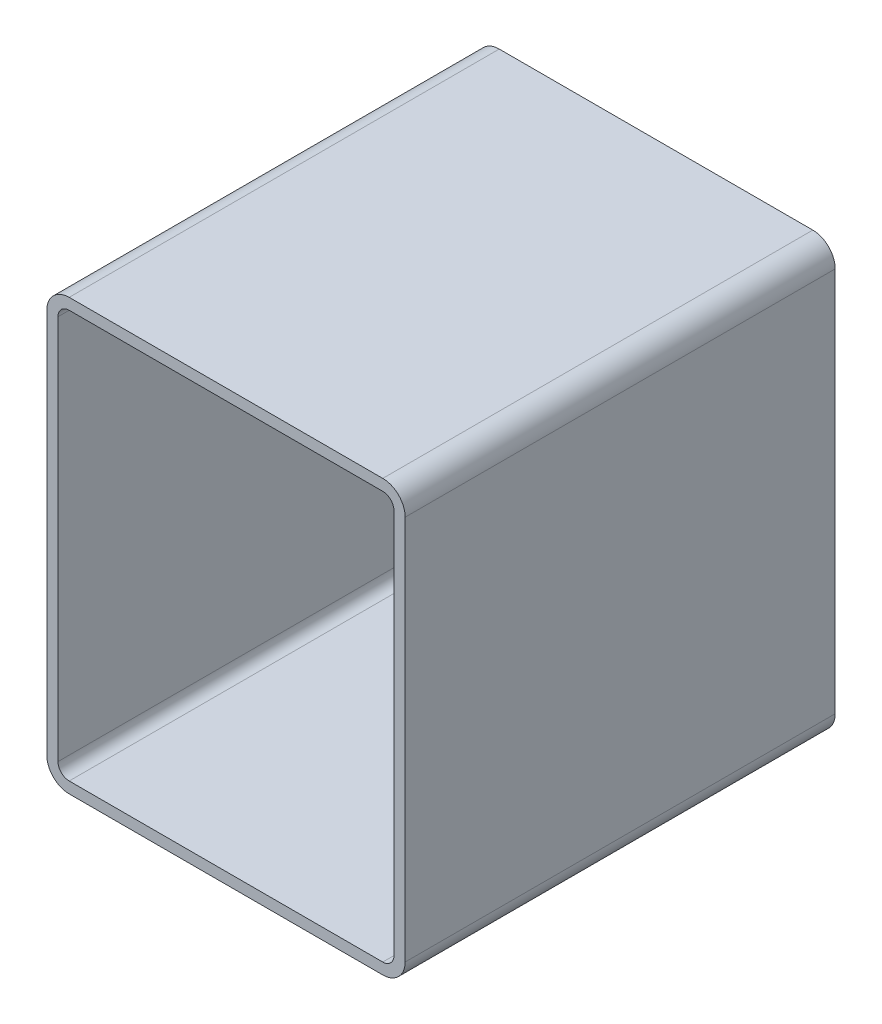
ISO-10303-21;
HEADER;
FILE_DESCRIPTION(('STEP AP214'),'2;1');
FILE_NAME('part.step','',(''),(''),'','','');
FILE_SCHEMA(('AUTOMOTIVE_DESIGN { 1 0 10303 214 1 1 1 1 }'));
ENDSEC;
DATA;
#1=APPLICATION_CONTEXT('core data for automotive mechanical design processes');
#2=APPLICATION_PROTOCOL_DEFINITION('international standard','automotive_design',2000,#1);
#3=PRODUCT_CONTEXT('',#1,'mechanical');
#4=PRODUCT('Part','Part','',(#3));
#5=PRODUCT_RELATED_PRODUCT_CATEGORY('part','',(#4));
#6=PRODUCT_DEFINITION_FORMATION('','',#4);
#7=PRODUCT_DEFINITION_CONTEXT('part definition',#1,'design');
#8=PRODUCT_DEFINITION('design','',#6,#7);
#9=PRODUCT_DEFINITION_SHAPE('','',#8);
#10=(LENGTH_UNIT() NAMED_UNIT(*) SI_UNIT(.MILLI.,.METRE.));
#11=(NAMED_UNIT(*) PLANE_ANGLE_UNIT() SI_UNIT($,.RADIAN.));
#12=(NAMED_UNIT(*) SI_UNIT($,.STERADIAN.) SOLID_ANGLE_UNIT());
#13=UNCERTAINTY_MEASURE_WITH_UNIT(LENGTH_MEASURE(1.E-05),#10,'distance_accuracy_value','');
#14=(GEOMETRIC_REPRESENTATION_CONTEXT(3) GLOBAL_UNCERTAINTY_ASSIGNED_CONTEXT((#13)) GLOBAL_UNIT_ASSIGNED_CONTEXT((#10,
#11,#12)) REPRESENTATION_CONTEXT('',''));
#15=CARTESIAN_POINT('',(0.,0.,0.));
#16=DIRECTION('',(0.,0.,1.));
#17=DIRECTION('',(1.,0.,0.));
#18=AXIS2_PLACEMENT_3D('',#15,#16,#17);
#19=CARTESIAN_POINT('',(18.6095794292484,290.799496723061,304.8));
#20=DIRECTION('',(0.,0.,1.));
#21=DIRECTION('',(1.,0.,0.));
#22=AXIS2_PLACEMENT_3D('',#19,#20,#21);
#23=PLANE('',#22);
#24=CARTESIAN_POINT('',(18.6095794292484,290.799496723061,304.8));
#25=DIRECTION('',(0.,0.,1.));
#26=DIRECTION('',(1.,0.,0.));
#27=AXIS2_PLACEMENT_3D('',#24,#25,#26);
#28=CIRCLE('',#27,15.875);
#29=CARTESIAN_POINT('',(18.6095794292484,306.674496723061,304.8));
#30=VERTEX_POINT('',#29);
#31=CARTESIAN_POINT('',(2.73457942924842,290.799496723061,304.8));
#32=VERTEX_POINT('',#31);
#33=EDGE_CURVE('E211',#30,#32,#28,.T.);
#34=ORIENTED_EDGE('',*,*,#33,.T.);
#35=DIRECTION('',(0.,-1.,0.));
#36=VECTOR('',#35,1.);
#37=CARTESIAN_POINT('',(2.73457942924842,17.7494967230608,304.8));
#38=LINE('',#37,#36);
#39=CARTESIAN_POINT('',(2.73457942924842,17.7494967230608,304.8));
#40=VERTEX_POINT('',#39);
#41=EDGE_CURVE('E214',#32,#40,#38,.T.);
#42=ORIENTED_EDGE('',*,*,#41,.T.);
#43=CARTESIAN_POINT('',(18.6095794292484,17.7494967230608,304.8));
#44=DIRECTION('',(0.,0.,1.));
#45=DIRECTION('',(1.,0.,0.));
#46=AXIS2_PLACEMENT_3D('',#43,#44,#45);
#47=CIRCLE('',#46,15.875);
#48=CARTESIAN_POINT('',(18.6095794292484,1.87449672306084,304.8));
#49=VERTEX_POINT('',#48);
#50=EDGE_CURVE('E217',#40,#49,#47,.T.);
#51=ORIENTED_EDGE('',*,*,#50,.T.);
#52=DIRECTION('',(1.,0.,0.));
#53=VECTOR('',#52,1.);
#54=CARTESIAN_POINT('',(240.859579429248,1.87449672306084,304.8));
#55=LINE('',#54,#53);
#56=CARTESIAN_POINT('',(240.859579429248,1.87449672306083,304.8));
#57=VERTEX_POINT('',#56);
#58=EDGE_CURVE('E219',#49,#57,#55,.T.);
#59=ORIENTED_EDGE('',*,*,#58,.T.);
#60=CARTESIAN_POINT('',(240.859579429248,17.7494967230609,304.8));
#61=DIRECTION('',(0.,0.,1.));
#62=DIRECTION('',(1.,0.,0.));
#63=AXIS2_PLACEMENT_3D('',#60,#61,#62);
#64=CIRCLE('',#63,15.875);
#65=CARTESIAN_POINT('',(256.734579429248,17.7494967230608,304.8));
#66=VERTEX_POINT('',#65);
#67=EDGE_CURVE('E221',#57,#66,#64,.T.);
#68=ORIENTED_EDGE('',*,*,#67,.T.);
#69=DIRECTION('',(0.,1.,0.));
#70=VECTOR('',#69,1.);
#71=CARTESIAN_POINT('',(256.734579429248,290.799496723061,304.8));
#72=LINE('',#71,#70);
#73=CARTESIAN_POINT('',(256.734579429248,290.799496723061,304.8));
#74=VERTEX_POINT('',#73);
#75=EDGE_CURVE('E223',#66,#74,#72,.T.);
#76=ORIENTED_EDGE('',*,*,#75,.T.);
#77=CARTESIAN_POINT('',(240.859579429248,290.799496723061,304.8));
#78=DIRECTION('',(0.,0.,1.));
#79=DIRECTION('',(1.,0.,0.));
#80=AXIS2_PLACEMENT_3D('',#77,#78,#79);
#81=CIRCLE('',#80,15.875);
#82=CARTESIAN_POINT('',(240.859579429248,306.674496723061,304.8));
#83=VERTEX_POINT('',#82);
#84=EDGE_CURVE('E225',#74,#83,#81,.T.);
#85=ORIENTED_EDGE('',*,*,#84,.T.);
#86=DIRECTION('',(-1.,0.,0.));
#87=VECTOR('',#86,1.);
#88=CARTESIAN_POINT('',(18.6095794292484,306.674496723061,304.8));
#89=LINE('',#88,#87);
#90=EDGE_CURVE('E227',#83,#30,#89,.T.);
#91=ORIENTED_EDGE('',*,*,#90,.T.);
#92=EDGE_LOOP('',(#34,#42,#51,#59,#68,#76,#85,#91));
#93=FACE_BOUND('',#92,.T.);
#94=DIRECTION('',(0.,-1.,0.));
#95=VECTOR('',#94,1.);
#96=CARTESIAN_POINT('',(10.6720794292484,17.7494967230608,304.8));
#97=LINE('',#96,#95);
#98=CARTESIAN_POINT('',(10.6720794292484,290.799496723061,304.8));
#99=VERTEX_POINT('',#98);
#100=CARTESIAN_POINT('',(10.6720794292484,17.7494967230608,304.8));
#101=VERTEX_POINT('',#100);
#102=EDGE_CURVE('E154',#99,#101,#97,.T.);
#103=ORIENTED_EDGE('',*,*,#102,.F.);
#104=CARTESIAN_POINT('',(18.6095794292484,290.799496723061,304.8));
#105=DIRECTION('',(0.,0.,1.));
#106=DIRECTION('',(1.,0.,0.));
#107=AXIS2_PLACEMENT_3D('',#104,#105,#106);
#108=CIRCLE('',#107,7.9375);
#109=CARTESIAN_POINT('',(18.6095794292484,298.736996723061,304.8));
#110=VERTEX_POINT('',#109);
#111=EDGE_CURVE('E146',#110,#99,#108,.T.);
#112=ORIENTED_EDGE('',*,*,#111,.F.);
#113=DIRECTION('',(-1.,0.,0.));
#114=VECTOR('',#113,1.);
#115=CARTESIAN_POINT('',(18.6095794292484,298.736996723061,304.8));
#116=LINE('',#115,#114);
#117=CARTESIAN_POINT('',(240.859579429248,298.736996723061,304.8));
#118=VERTEX_POINT('',#117);
#119=EDGE_CURVE('E179',#118,#110,#116,.T.);
#120=ORIENTED_EDGE('',*,*,#119,.F.);
#121=CARTESIAN_POINT('',(240.859579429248,290.799496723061,304.8));
#122=DIRECTION('',(0.,0.,1.));
#123=DIRECTION('',(1.,0.,0.));
#124=AXIS2_PLACEMENT_3D('',#121,#122,#123);
#125=CIRCLE('',#124,7.9375);
#126=CARTESIAN_POINT('',(248.797079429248,290.799496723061,304.8));
#127=VERTEX_POINT('',#126);
#128=EDGE_CURVE('E177',#127,#118,#125,.T.);
#129=ORIENTED_EDGE('',*,*,#128,.F.);
#130=DIRECTION('',(0.,1.,0.));
#131=VECTOR('',#130,1.);
#132=CARTESIAN_POINT('',(248.797079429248,290.799496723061,304.8));
#133=LINE('',#132,#131);
#134=CARTESIAN_POINT('',(248.797079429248,17.7494967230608,304.8));
#135=VERTEX_POINT('',#134);
#136=EDGE_CURVE('E175',#135,#127,#133,.T.);
#137=ORIENTED_EDGE('',*,*,#136,.F.);
#138=CARTESIAN_POINT('',(240.859579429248,17.7494967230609,304.8));
#139=DIRECTION('',(0.,0.,1.));
#140=DIRECTION('',(1.,0.,0.));
#141=AXIS2_PLACEMENT_3D('',#138,#139,#140);
#142=CIRCLE('',#141,7.93750000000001);
#143=CARTESIAN_POINT('',(240.859579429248,9.81199672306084,304.8));
#144=VERTEX_POINT('',#143);
#145=EDGE_CURVE('E173',#144,#135,#142,.T.);
#146=ORIENTED_EDGE('',*,*,#145,.F.);
#147=DIRECTION('',(1.,0.,0.));
#148=VECTOR('',#147,1.);
#149=CARTESIAN_POINT('',(240.859579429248,9.81199672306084,304.8));
#150=LINE('',#149,#148);
#151=CARTESIAN_POINT('',(18.6095794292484,9.81199672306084,304.8));
#152=VERTEX_POINT('',#151);
#153=EDGE_CURVE('E169',#152,#144,#150,.T.);
#154=ORIENTED_EDGE('',*,*,#153,.F.);
#155=CARTESIAN_POINT('',(18.6095794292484,17.7494967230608,304.8));
#156=DIRECTION('',(0.,0.,1.));
#157=DIRECTION('',(1.,0.,0.));
#158=AXIS2_PLACEMENT_3D('',#155,#156,#157);
#159=CIRCLE('',#158,7.9375);
#160=EDGE_CURVE('E167',#101,#152,#159,.T.);
#161=ORIENTED_EDGE('',*,*,#160,.F.);
#162=EDGE_LOOP('',(#103,#112,#120,#129,#137,#146,#154,#161));
#163=FACE_BOUND('',#162,.T.);
#164=ADVANCED_FACE('F33',(#93,#163),#23,.T.);
#165=CARTESIAN_POINT('',(18.6095794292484,290.799496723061,0.));
#166=DIRECTION('',(0.,0.,1.));
#167=DIRECTION('',(1.,0.,0.));
#168=AXIS2_PLACEMENT_3D('',#165,#166,#167);
#169=PLANE('',#168);
#170=CARTESIAN_POINT('',(18.6095794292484,290.799496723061,0.));
#171=DIRECTION('',(0.,0.,1.));
#172=DIRECTION('',(1.,0.,0.));
#173=AXIS2_PLACEMENT_3D('',#170,#171,#172);
#174=CIRCLE('',#173,15.875);
#175=CARTESIAN_POINT('',(18.6095794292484,306.674496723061,0.));
#176=VERTEX_POINT('',#175);
#177=CARTESIAN_POINT('',(2.73457942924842,290.799496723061,0.));
#178=VERTEX_POINT('',#177);
#179=EDGE_CURVE('E162',#176,#178,#174,.T.);
#180=ORIENTED_EDGE('',*,*,#179,.F.);
#181=DIRECTION('',(-1.,0.,0.));
#182=VECTOR('',#181,1.);
#183=CARTESIAN_POINT('',(18.6095794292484,306.674496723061,0.));
#184=LINE('',#183,#182);
#185=CARTESIAN_POINT('',(240.859579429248,306.674496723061,0.));
#186=VERTEX_POINT('',#185);
#187=EDGE_CURVE('E215',#186,#176,#184,.T.);
#188=ORIENTED_EDGE('',*,*,#187,.F.);
#189=CARTESIAN_POINT('',(240.859579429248,290.799496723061,0.));
#190=DIRECTION('',(0.,0.,1.));
#191=DIRECTION('',(1.,0.,0.));
#192=AXIS2_PLACEMENT_3D('',#189,#190,#191);
#193=CIRCLE('',#192,15.875);
#194=CARTESIAN_POINT('',(256.734579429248,290.799496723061,0.));
#195=VERTEX_POINT('',#194);
#196=EDGE_CURVE('E242',#195,#186,#193,.T.);
#197=ORIENTED_EDGE('',*,*,#196,.F.);
#198=DIRECTION('',(0.,1.,0.));
#199=VECTOR('',#198,1.);
#200=CARTESIAN_POINT('',(256.734579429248,290.799496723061,0.));
#201=LINE('',#200,#199);
#202=CARTESIAN_POINT('',(256.734579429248,17.7494967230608,0.));
#203=VERTEX_POINT('',#202);
#204=EDGE_CURVE('E240',#203,#195,#201,.T.);
#205=ORIENTED_EDGE('',*,*,#204,.F.);
#206=CARTESIAN_POINT('',(240.859579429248,17.7494967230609,0.));
#207=DIRECTION('',(0.,0.,1.));
#208=DIRECTION('',(1.,0.,0.));
#209=AXIS2_PLACEMENT_3D('',#206,#207,#208);
#210=CIRCLE('',#209,15.875);
#211=CARTESIAN_POINT('',(240.859579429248,1.87449672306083,0.));
#212=VERTEX_POINT('',#211);
#213=EDGE_CURVE('E238',#212,#203,#210,.T.);
#214=ORIENTED_EDGE('',*,*,#213,.F.);
#215=DIRECTION('',(1.,0.,0.));
#216=VECTOR('',#215,1.);
#217=CARTESIAN_POINT('',(240.859579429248,1.87449672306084,0.));
#218=LINE('',#217,#216);
#219=CARTESIAN_POINT('',(18.6095794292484,1.87449672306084,0.));
#220=VERTEX_POINT('',#219);
#221=EDGE_CURVE('E236',#220,#212,#218,.T.);
#222=ORIENTED_EDGE('',*,*,#221,.F.);
#223=CARTESIAN_POINT('',(18.6095794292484,17.7494967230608,0.));
#224=DIRECTION('',(0.,0.,1.));
#225=DIRECTION('',(1.,0.,0.));
#226=AXIS2_PLACEMENT_3D('',#223,#224,#225);
#227=CIRCLE('',#226,15.875);
#228=CARTESIAN_POINT('',(2.73457942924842,17.7494967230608,0.));
#229=VERTEX_POINT('',#228);
#230=EDGE_CURVE('E234',#229,#220,#227,.T.);
#231=ORIENTED_EDGE('',*,*,#230,.F.);
#232=DIRECTION('',(0.,-1.,0.));
#233=VECTOR('',#232,1.);
#234=CARTESIAN_POINT('',(2.73457942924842,17.7494967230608,0.));
#235=LINE('',#234,#233);
#236=EDGE_CURVE('E232',#178,#229,#235,.T.);
#237=ORIENTED_EDGE('',*,*,#236,.F.);
#238=EDGE_LOOP('',(#180,#188,#197,#205,#214,#222,#231,#237));
#239=FACE_BOUND('',#238,.T.);
#240=CARTESIAN_POINT('',(18.6095794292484,290.799496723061,0.));
#241=DIRECTION('',(0.,0.,1.));
#242=DIRECTION('',(1.,0.,0.));
#243=AXIS2_PLACEMENT_3D('',#240,#241,#242);
#244=CIRCLE('',#243,7.9375);
#245=CARTESIAN_POINT('',(18.6095794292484,298.736996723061,0.));
#246=VERTEX_POINT('',#245);
#247=CARTESIAN_POINT('',(10.6720794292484,290.799496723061,0.));
#248=VERTEX_POINT('',#247);
#249=EDGE_CURVE('E56',#246,#248,#244,.T.);
#250=ORIENTED_EDGE('',*,*,#249,.T.);
#251=DIRECTION('',(0.,-1.,0.));
#252=VECTOR('',#251,1.);
#253=CARTESIAN_POINT('',(10.6720794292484,17.7494967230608,0.));
#254=LINE('',#253,#252);
#255=CARTESIAN_POINT('',(10.6720794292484,17.7494967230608,0.));
#256=VERTEX_POINT('',#255);
#257=EDGE_CURVE('E161',#248,#256,#254,.T.);
#258=ORIENTED_EDGE('',*,*,#257,.T.);
#259=CARTESIAN_POINT('',(18.6095794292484,17.7494967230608,0.));
#260=DIRECTION('',(0.,0.,1.));
#261=DIRECTION('',(1.,0.,0.));
#262=AXIS2_PLACEMENT_3D('',#259,#260,#261);
#263=CIRCLE('',#262,7.9375);
#264=CARTESIAN_POINT('',(18.6095794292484,9.81199672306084,0.));
#265=VERTEX_POINT('',#264);
#266=EDGE_CURVE('E183',#256,#265,#263,.T.);
#267=ORIENTED_EDGE('',*,*,#266,.T.);
#268=DIRECTION('',(1.,0.,0.));
#269=VECTOR('',#268,1.);
#270=CARTESIAN_POINT('',(240.859579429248,9.81199672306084,0.));
#271=LINE('',#270,#269);
#272=CARTESIAN_POINT('',(240.859579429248,9.81199672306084,0.));
#273=VERTEX_POINT('',#272);
#274=EDGE_CURVE('E186',#265,#273,#271,.T.);
#275=ORIENTED_EDGE('',*,*,#274,.T.);
#276=CARTESIAN_POINT('',(240.859579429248,17.7494967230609,0.));
#277=DIRECTION('',(0.,0.,1.));
#278=DIRECTION('',(1.,0.,0.));
#279=AXIS2_PLACEMENT_3D('',#276,#277,#278);
#280=CIRCLE('',#279,7.93750000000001);
#281=CARTESIAN_POINT('',(248.797079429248,17.7494967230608,0.));
#282=VERTEX_POINT('',#281);
#283=EDGE_CURVE('E189',#273,#282,#280,.T.);
#284=ORIENTED_EDGE('',*,*,#283,.T.);
#285=DIRECTION('',(0.,1.,0.));
#286=VECTOR('',#285,1.);
#287=CARTESIAN_POINT('',(248.797079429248,290.799496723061,0.));
#288=LINE('',#287,#286);
#289=CARTESIAN_POINT('',(248.797079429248,290.799496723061,0.));
#290=VERTEX_POINT('',#289);
#291=EDGE_CURVE('E192',#282,#290,#288,.T.);
#292=ORIENTED_EDGE('',*,*,#291,.T.);
#293=CARTESIAN_POINT('',(240.859579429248,290.799496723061,0.));
#294=DIRECTION('',(0.,0.,1.));
#295=DIRECTION('',(1.,0.,0.));
#296=AXIS2_PLACEMENT_3D('',#293,#294,#295);
#297=CIRCLE('',#296,7.9375);
#298=CARTESIAN_POINT('',(240.859579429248,298.736996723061,0.));
#299=VERTEX_POINT('',#298);
#300=EDGE_CURVE('E195',#290,#299,#297,.T.);
#301=ORIENTED_EDGE('',*,*,#300,.T.);
#302=DIRECTION('',(-1.,0.,0.));
#303=VECTOR('',#302,1.);
#304=CARTESIAN_POINT('',(18.6095794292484,298.736996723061,0.));
#305=LINE('',#304,#303);
#306=EDGE_CURVE('E155',#299,#246,#305,.T.);
#307=ORIENTED_EDGE('',*,*,#306,.T.);
#308=EDGE_LOOP('',(#250,#258,#267,#275,#284,#292,#301,#307));
#309=FACE_BOUND('',#308,.T.);
#310=ADVANCED_FACE('F272',(#239,#309),#169,.F.);
#311=CARTESIAN_POINT('',(18.6095794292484,290.799496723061,304.8));
#312=DIRECTION('',(0.,0.,-1.));
#313=DIRECTION('',(-1.,0.,0.));
#314=AXIS2_PLACEMENT_3D('',#311,#312,#313);
#315=CYLINDRICAL_SURFACE('',#314,15.875);
#316=ORIENTED_EDGE('',*,*,#179,.T.);
#317=DIRECTION('',(0.,0.,-1.));
#318=VECTOR('',#317,1.);
#319=CARTESIAN_POINT('',(2.73457942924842,290.799496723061,304.8));
#320=LINE('',#319,#318);
#321=EDGE_CURVE('E11',#32,#178,#320,.T.);
#322=ORIENTED_EDGE('',*,*,#321,.F.);
#323=ORIENTED_EDGE('',*,*,#33,.F.);
#324=DIRECTION('',(0.,0.,-1.));
#325=VECTOR('',#324,1.);
#326=CARTESIAN_POINT('',(18.6095794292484,306.674496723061,304.8));
#327=LINE('',#326,#325);
#328=EDGE_CURVE('E229',#30,#176,#327,.T.);
#329=ORIENTED_EDGE('',*,*,#328,.T.);
#330=EDGE_LOOP('',(#316,#322,#323,#329));
#331=FACE_BOUND('',#330,.T.);
#332=ADVANCED_FACE('F35',(#331),#315,.T.);
#333=CARTESIAN_POINT('',(2.73457942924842,17.7494967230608,304.8));
#334=DIRECTION('',(1.,0.,0.));
#335=DIRECTION('',(0.,0.,-1.));
#336=AXIS2_PLACEMENT_3D('',#333,#334,#335);
#337=PLANE('',#336);
#338=ORIENTED_EDGE('',*,*,#236,.T.);
#339=DIRECTION('',(0.,0.,-1.));
#340=VECTOR('',#339,1.);
#341=CARTESIAN_POINT('',(2.73457942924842,17.7494967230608,304.8));
#342=LINE('',#341,#340);
#343=EDGE_CURVE('E41',#40,#229,#342,.T.);
#344=ORIENTED_EDGE('',*,*,#343,.F.);
#345=ORIENTED_EDGE('',*,*,#41,.F.);
#346=ORIENTED_EDGE('',*,*,#321,.T.);
#347=EDGE_LOOP('',(#338,#344,#345,#346));
#348=FACE_BOUND('',#347,.T.);
#349=ADVANCED_FACE('F289',(#348),#337,.F.);
#350=CARTESIAN_POINT('',(18.6095794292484,17.7494967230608,304.8));
#351=DIRECTION('',(0.,0.,-1.));
#352=DIRECTION('',(-1.,0.,0.));
#353=AXIS2_PLACEMENT_3D('',#350,#351,#352);
#354=CYLINDRICAL_SURFACE('',#353,15.875);
#355=ORIENTED_EDGE('',*,*,#230,.T.);
#356=DIRECTION('',(0.,0.,-1.));
#357=VECTOR('',#356,1.);
#358=CARTESIAN_POINT('',(18.6095794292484,1.87449672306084,304.8));
#359=LINE('',#358,#357);
#360=EDGE_CURVE('E259',#49,#220,#359,.T.);
#361=ORIENTED_EDGE('',*,*,#360,.F.);
#362=ORIENTED_EDGE('',*,*,#50,.F.);
#363=ORIENTED_EDGE('',*,*,#343,.T.);
#364=EDGE_LOOP('',(#355,#361,#362,#363));
#365=FACE_BOUND('',#364,.T.);
#366=ADVANCED_FACE('F266',(#365),#354,.T.);
#367=CARTESIAN_POINT('',(240.859579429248,1.87449672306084,304.8));
#368=DIRECTION('',(0.,1.,0.));
#369=DIRECTION('',(0.,0.,1.));
#370=AXIS2_PLACEMENT_3D('',#367,#368,#369);
#371=PLANE('',#370);
#372=ORIENTED_EDGE('',*,*,#221,.T.);
#373=DIRECTION('',(0.,0.,-1.));
#374=VECTOR('',#373,1.);
#375=CARTESIAN_POINT('',(240.859579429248,1.87449672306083,304.8));
#376=LINE('',#375,#374);
#377=EDGE_CURVE('E256',#57,#212,#376,.T.);
#378=ORIENTED_EDGE('',*,*,#377,.F.);
#379=ORIENTED_EDGE('',*,*,#58,.F.);
#380=ORIENTED_EDGE('',*,*,#360,.T.);
#381=EDGE_LOOP('',(#372,#378,#379,#380));
#382=FACE_BOUND('',#381,.T.);
#383=ADVANCED_FACE('F278',(#382),#371,.F.);
#384=CARTESIAN_POINT('',(240.859579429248,17.7494967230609,304.8));
#385=DIRECTION('',(0.,0.,-1.));
#386=DIRECTION('',(-1.,0.,0.));
#387=AXIS2_PLACEMENT_3D('',#384,#385,#386);
#388=CYLINDRICAL_SURFACE('',#387,15.875);
#389=ORIENTED_EDGE('',*,*,#213,.T.);
#390=DIRECTION('',(0.,0.,-1.));
#391=VECTOR('',#390,1.);
#392=CARTESIAN_POINT('',(256.734579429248,17.7494967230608,304.8));
#393=LINE('',#392,#391);
#394=EDGE_CURVE('E253',#66,#203,#393,.T.);
#395=ORIENTED_EDGE('',*,*,#394,.F.);
#396=ORIENTED_EDGE('',*,*,#67,.F.);
#397=ORIENTED_EDGE('',*,*,#377,.T.);
#398=EDGE_LOOP('',(#389,#395,#396,#397));
#399=FACE_BOUND('',#398,.T.);
#400=ADVANCED_FACE('F282',(#399),#388,.T.);
#401=CARTESIAN_POINT('',(256.734579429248,290.799496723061,304.8));
#402=DIRECTION('',(-1.,0.,0.));
#403=DIRECTION('',(0.,0.,1.));
#404=AXIS2_PLACEMENT_3D('',#401,#402,#403);
#405=PLANE('',#404);
#406=ORIENTED_EDGE('',*,*,#204,.T.);
#407=DIRECTION('',(0.,0.,-1.));
#408=VECTOR('',#407,1.);
#409=CARTESIAN_POINT('',(256.734579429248,290.799496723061,304.8));
#410=LINE('',#409,#408);
#411=EDGE_CURVE('E250',#74,#195,#410,.T.);
#412=ORIENTED_EDGE('',*,*,#411,.F.);
#413=ORIENTED_EDGE('',*,*,#75,.F.);
#414=ORIENTED_EDGE('',*,*,#394,.T.);
#415=EDGE_LOOP('',(#406,#412,#413,#414));
#416=FACE_BOUND('',#415,.T.);
#417=ADVANCED_FACE('F302',(#416),#405,.F.);
#418=CARTESIAN_POINT('',(240.859579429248,290.799496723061,304.8));
#419=DIRECTION('',(0.,0.,-1.));
#420=DIRECTION('',(-1.,0.,0.));
#421=AXIS2_PLACEMENT_3D('',#418,#419,#420);
#422=CYLINDRICAL_SURFACE('',#421,15.875);
#423=ORIENTED_EDGE('',*,*,#196,.T.);
#424=DIRECTION('',(0.,0.,-1.));
#425=VECTOR('',#424,1.);
#426=CARTESIAN_POINT('',(240.859579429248,306.674496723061,304.8));
#427=LINE('',#426,#425);
#428=EDGE_CURVE('E247',#83,#186,#427,.T.);
#429=ORIENTED_EDGE('',*,*,#428,.F.);
#430=ORIENTED_EDGE('',*,*,#84,.F.);
#431=ORIENTED_EDGE('',*,*,#411,.T.);
#432=EDGE_LOOP('',(#423,#429,#430,#431));
#433=FACE_BOUND('',#432,.T.);
#434=ADVANCED_FACE('F300',(#433),#422,.T.);
#435=CARTESIAN_POINT('',(18.6095794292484,306.674496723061,304.8));
#436=DIRECTION('',(0.,-1.,0.));
#437=DIRECTION('',(0.,0.,-1.));
#438=AXIS2_PLACEMENT_3D('',#435,#436,#437);
#439=PLANE('',#438);
#440=ORIENTED_EDGE('',*,*,#187,.T.);
#441=ORIENTED_EDGE('',*,*,#328,.F.);
#442=ORIENTED_EDGE('',*,*,#90,.F.);
#443=ORIENTED_EDGE('',*,*,#428,.T.);
#444=EDGE_LOOP('',(#440,#441,#442,#443));
#445=FACE_BOUND('',#444,.T.);
#446=ADVANCED_FACE('F295',(#445),#439,.F.);
#447=CARTESIAN_POINT('',(18.6095794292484,290.799496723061,304.8));
#448=DIRECTION('',(0.,0.,-1.));
#449=DIRECTION('',(-1.,0.,0.));
#450=AXIS2_PLACEMENT_3D('',#447,#448,#449);
#451=CYLINDRICAL_SURFACE('',#450,7.9375);
#452=ORIENTED_EDGE('',*,*,#249,.F.);
#453=DIRECTION('',(0.,0.,-1.));
#454=VECTOR('',#453,1.);
#455=CARTESIAN_POINT('',(18.6095794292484,298.736996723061,304.8));
#456=LINE('',#455,#454);
#457=EDGE_CURVE('E150',#110,#246,#456,.T.);
#458=ORIENTED_EDGE('',*,*,#457,.F.);
#459=ORIENTED_EDGE('',*,*,#111,.T.);
#460=DIRECTION('',(0.,0.,-1.));
#461=VECTOR('',#460,1.);
#462=CARTESIAN_POINT('',(10.6720794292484,290.799496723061,304.8));
#463=LINE('',#462,#461);
#464=EDGE_CURVE('E149',#99,#248,#463,.T.);
#465=ORIENTED_EDGE('',*,*,#464,.T.);
#466=EDGE_LOOP('',(#452,#458,#459,#465));
#467=FACE_BOUND('',#466,.T.);
#468=ADVANCED_FACE('F148',(#467),#451,.F.);
#469=CARTESIAN_POINT('',(10.6720794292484,17.7494967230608,304.8));
#470=DIRECTION('',(1.,0.,0.));
#471=DIRECTION('',(0.,0.,-1.));
#472=AXIS2_PLACEMENT_3D('',#469,#470,#471);
#473=PLANE('',#472);
#474=ORIENTED_EDGE('',*,*,#257,.F.);
#475=ORIENTED_EDGE('',*,*,#464,.F.);
#476=ORIENTED_EDGE('',*,*,#102,.T.);
#477=DIRECTION('',(0.,0.,-1.));
#478=VECTOR('',#477,1.);
#479=CARTESIAN_POINT('',(10.6720794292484,17.7494967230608,304.8));
#480=LINE('',#479,#478);
#481=EDGE_CURVE('E163',#101,#256,#480,.T.);
#482=ORIENTED_EDGE('',*,*,#481,.T.);
#483=EDGE_LOOP('',(#474,#475,#476,#482));
#484=FACE_BOUND('',#483,.T.);
#485=ADVANCED_FACE('F158',(#484),#473,.T.);
#486=CARTESIAN_POINT('',(18.6095794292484,17.7494967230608,304.8));
#487=DIRECTION('',(0.,0.,-1.));
#488=DIRECTION('',(-1.,0.,0.));
#489=AXIS2_PLACEMENT_3D('',#486,#487,#488);
#490=CYLINDRICAL_SURFACE('',#489,7.9375);
#491=ORIENTED_EDGE('',*,*,#266,.F.);
#492=ORIENTED_EDGE('',*,*,#481,.F.);
#493=ORIENTED_EDGE('',*,*,#160,.T.);
#494=DIRECTION('',(0.,0.,-1.));
#495=VECTOR('',#494,1.);
#496=CARTESIAN_POINT('',(18.6095794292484,9.81199672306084,304.8));
#497=LINE('',#496,#495);
#498=EDGE_CURVE('E208',#152,#265,#497,.T.);
#499=ORIENTED_EDGE('',*,*,#498,.T.);
#500=EDGE_LOOP('',(#491,#492,#493,#499));
#501=FACE_BOUND('',#500,.T.);
#502=ADVANCED_FACE('F327',(#501),#490,.F.);
#503=CARTESIAN_POINT('',(240.859579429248,9.81199672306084,304.8));
#504=DIRECTION('',(0.,1.,0.));
#505=DIRECTION('',(0.,0.,1.));
#506=AXIS2_PLACEMENT_3D('',#503,#504,#505);
#507=PLANE('',#506);
#508=ORIENTED_EDGE('',*,*,#274,.F.);
#509=ORIENTED_EDGE('',*,*,#498,.F.);
#510=ORIENTED_EDGE('',*,*,#153,.T.);
#511=DIRECTION('',(0.,0.,-1.));
#512=VECTOR('',#511,1.);
#513=CARTESIAN_POINT('',(240.859579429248,9.81199672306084,304.8));
#514=LINE('',#513,#512);
#515=EDGE_CURVE('E206',#144,#273,#514,.T.);
#516=ORIENTED_EDGE('',*,*,#515,.T.);
#517=EDGE_LOOP('',(#508,#509,#510,#516));
#518=FACE_BOUND('',#517,.T.);
#519=ADVANCED_FACE('F331',(#518),#507,.T.);
#520=CARTESIAN_POINT('',(240.859579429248,17.7494967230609,304.8));
#521=DIRECTION('',(0.,0.,-1.));
#522=DIRECTION('',(-1.,0.,0.));
#523=AXIS2_PLACEMENT_3D('',#520,#521,#522);
#524=CYLINDRICAL_SURFACE('',#523,7.93750000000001);
#525=ORIENTED_EDGE('',*,*,#283,.F.);
#526=ORIENTED_EDGE('',*,*,#515,.F.);
#527=ORIENTED_EDGE('',*,*,#145,.T.);
#528=DIRECTION('',(0.,0.,-1.));
#529=VECTOR('',#528,1.);
#530=CARTESIAN_POINT('',(248.797079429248,17.7494967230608,304.8));
#531=LINE('',#530,#529);
#532=EDGE_CURVE('E204',#135,#282,#531,.T.);
#533=ORIENTED_EDGE('',*,*,#532,.T.);
#534=EDGE_LOOP('',(#525,#526,#527,#533));
#535=FACE_BOUND('',#534,.T.);
#536=ADVANCED_FACE('F337',(#535),#524,.F.);
#537=CARTESIAN_POINT('',(248.797079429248,290.799496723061,304.8));
#538=DIRECTION('',(-1.,0.,0.));
#539=DIRECTION('',(0.,0.,1.));
#540=AXIS2_PLACEMENT_3D('',#537,#538,#539);
#541=PLANE('',#540);
#542=ORIENTED_EDGE('',*,*,#291,.F.);
#543=ORIENTED_EDGE('',*,*,#532,.F.);
#544=ORIENTED_EDGE('',*,*,#136,.T.);
#545=DIRECTION('',(0.,0.,-1.));
#546=VECTOR('',#545,1.);
#547=CARTESIAN_POINT('',(248.797079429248,290.799496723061,304.8));
#548=LINE('',#547,#546);
#549=EDGE_CURVE('E202',#127,#290,#548,.T.);
#550=ORIENTED_EDGE('',*,*,#549,.T.);
#551=EDGE_LOOP('',(#542,#543,#544,#550));
#552=FACE_BOUND('',#551,.T.);
#553=ADVANCED_FACE('F341',(#552),#541,.T.);
#554=CARTESIAN_POINT('',(240.859579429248,290.799496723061,304.8));
#555=DIRECTION('',(0.,0.,-1.));
#556=DIRECTION('',(-1.,0.,0.));
#557=AXIS2_PLACEMENT_3D('',#554,#555,#556);
#558=CYLINDRICAL_SURFACE('',#557,7.9375);
#559=ORIENTED_EDGE('',*,*,#300,.F.);
#560=ORIENTED_EDGE('',*,*,#549,.F.);
#561=ORIENTED_EDGE('',*,*,#128,.T.);
#562=DIRECTION('',(0.,0.,-1.));
#563=VECTOR('',#562,1.);
#564=CARTESIAN_POINT('',(240.859579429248,298.736996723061,304.8));
#565=LINE('',#564,#563);
#566=EDGE_CURVE('E48',#118,#299,#565,.T.);
#567=ORIENTED_EDGE('',*,*,#566,.T.);
#568=EDGE_LOOP('',(#559,#560,#561,#567));
#569=FACE_BOUND('',#568,.T.);
#570=ADVANCED_FACE('F345',(#569),#558,.F.);
#571=CARTESIAN_POINT('',(18.6095794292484,298.736996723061,304.8));
#572=DIRECTION('',(0.,-1.,0.));
#573=DIRECTION('',(0.,0.,-1.));
#574=AXIS2_PLACEMENT_3D('',#571,#572,#573);
#575=PLANE('',#574);
#576=ORIENTED_EDGE('',*,*,#306,.F.);
#577=ORIENTED_EDGE('',*,*,#566,.F.);
#578=ORIENTED_EDGE('',*,*,#119,.T.);
#579=ORIENTED_EDGE('',*,*,#457,.T.);
#580=EDGE_LOOP('',(#576,#577,#578,#579));
#581=FACE_BOUND('',#580,.T.);
#582=ADVANCED_FACE('F349',(#581),#575,.T.);
#583=CLOSED_SHELL('',(#164,#310,#332,#349,#366,#383,#400,#417,#434,#446,#468,#485,#502,#519,
#536,#553,#570,#582));
#584=MANIFOLD_SOLID_BREP('B2',#583);
#585=ADVANCED_BREP_SHAPE_REPRESENTATION('',(#18,#584),#14);
#586=SHAPE_DEFINITION_REPRESENTATION(#9,#585);
ENDSEC;
END-ISO-10303-21;
